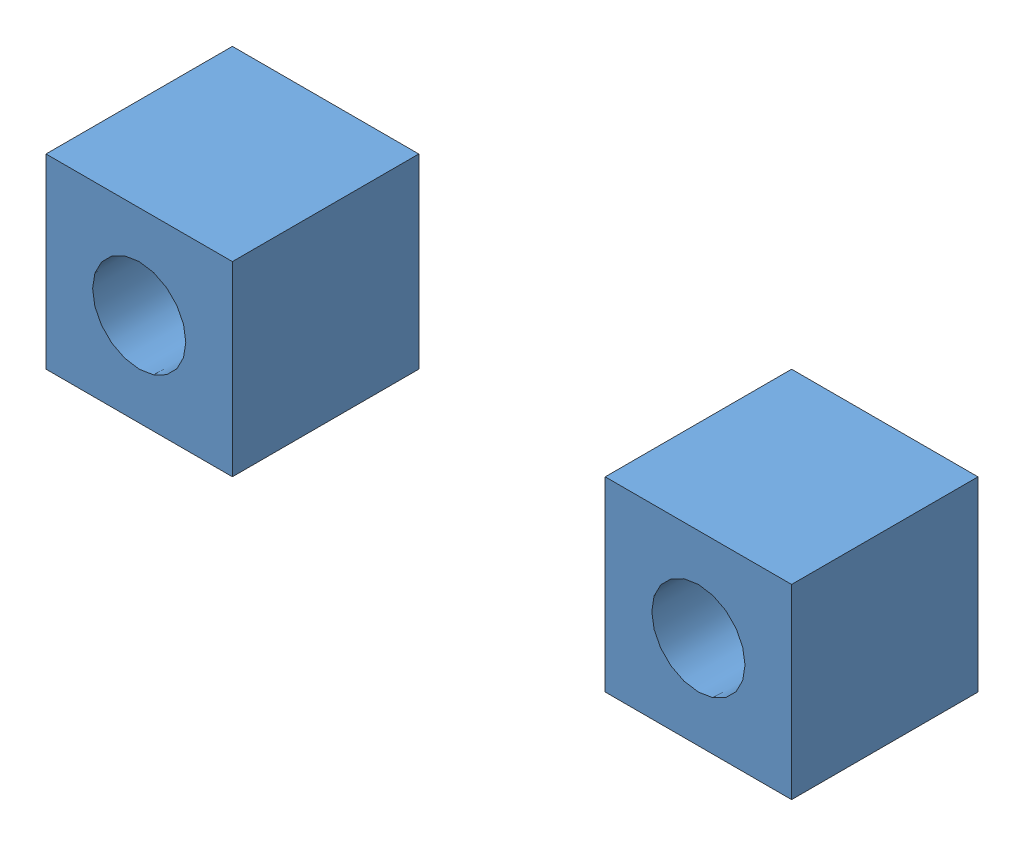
SolidWorks assembly PresentationTransform.SLDASM, configuration Default (file format 10000). Lengths in mm.
Overall size (40 23.75 40).
3 component instances, 1 part files, 3 mates.
Components (placement in the parent):
- SubAssm-1: SubAssm.sldasm [Default] at origin size (10 10 10)
  - box-1: box.SLDPRT [Default] at origin size (10 10 10)
- box-1: box.SLDPRT [Default] at (30 0 0) size (10 10 10)
Mates (geometry in assembly coordinates):
- Coincident1: coincident aligned: plane of SubAssm-1/box-1 through (-5 5 5) normal (0 1 0); plane of box-1 through (25 5 5) normal (0 1 0)
- Coincident2: coincident aligned: plane of SubAssm-1/box-1 through (0 0 5) normal (0 0 1); plane of box-1 through (30 0 5) normal (0 0 1)
- Distance1: distance = 20 mm anti-aligned: plane of SubAssm-1/box-1 through (5 -5 5) normal (1 0 0); plane of box-1 through (25 -5 5) normal (-1 0 0)
